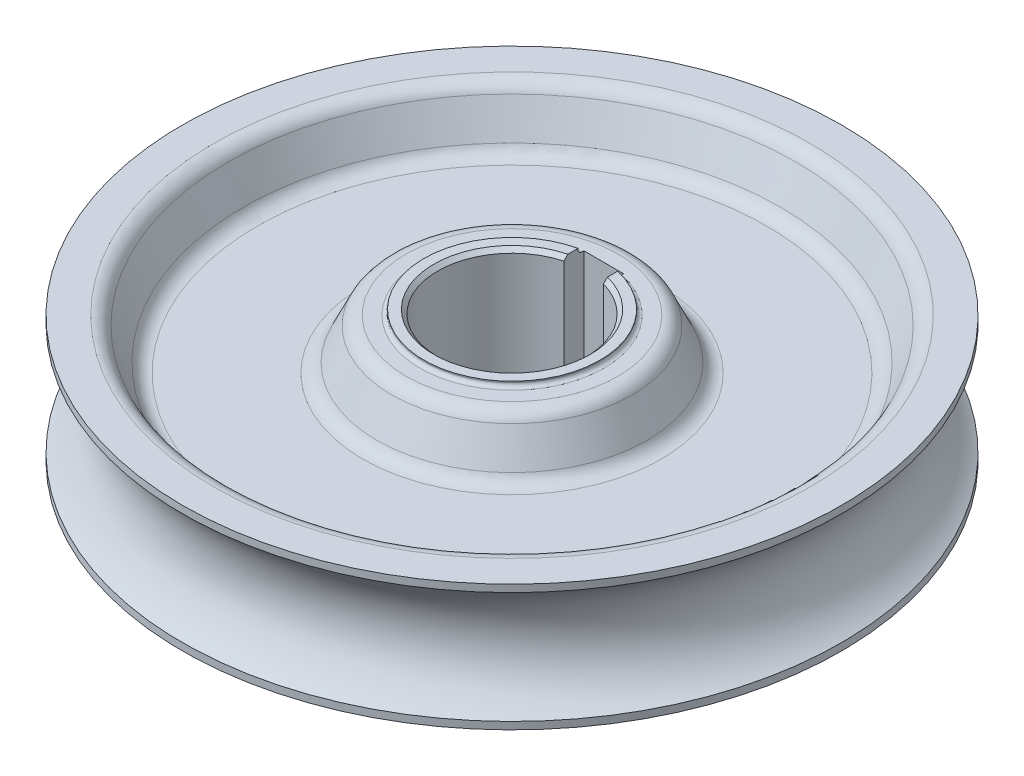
from build123d import *

# Parameters (mm, degrees)
CHAMFER1_SIZE      = 0.79375
SKETCH2_W          = 8
SKETCH2_H          = 18.5
CUT_EXTRUDE1_DEPTH = 99.00547448
SKETCH4_OUTSIDE_W  = 173.06
SKETCH4_OUTSIDE_H  = 173.06
SKETCH4_OUTSIDE_R  = 17.78
CUT_EXTRUDE2_DEPTH = 1.016
FILLET1_R          = 3.175
FILLET2_R          = 0.79375


with BuildPart() as part:
    # Sketch1 → Revolve1 (revolve)
    with BuildSketch(Plane(origin=(0, 0, 0), x_dir=(0, 0, -1), z_dir=(1, 0, 0))):
        with BuildLine():
            Line((66.51625, 11.260064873), (66.51625, 13.75))
            Line((66.51625, 13.75), (15, 13.75))
            Line((15, 13.75), (15, -13.75))
            Line((15, -13.75), (66.51625, -13.75))
            Line((66.51625, -13.75), (66.51625, -11.260064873))
            ThreePointArc((66.51625, -11.260064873), (60.325, 0), (66.51625, 11.260064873))
        make_face()
    revolve(axis=Axis((0, 0, 0), (0, 1, 0)))

    # Chamfer1
    chamfer1_edges = [part.edges().sort_by_distance(p)[0] for p in [
        (0, 13.75, 15),
        (0, -13.75, 15),
    ]]
    chamfer(chamfer1_edges, length=CHAMFER1_SIZE)

    # Sketch2 → Cut-Extrude1 (cut, through all)
    with BuildSketch(Plane(origin=(0, 13.75, 0), x_dir=(1, 0, 0), z_dir=(0, 1, 0))):
        with Locations((0, 9.25)):
            Rectangle(SKETCH2_W, SKETCH2_H)
    extrude(amount=-CUT_EXTRUDE1_DEPTH, mode=Mode.SUBTRACT)

    # Sketch3 → Cut-Revolve1 (revolve, cut)
    with BuildSketch(Plane(origin=(0, 0, 0), x_dir=(0, 0, -1), z_dir=(1, 0, 0)), mode=Mode.PRIVATE) as cut_revolve1_sk:
        Polygon((22.9375, -13.75), (28.119343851, -2.6375), (53.396906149, -2.6375), (58.57875, -13.75), align=None)
    cut_revolve1 = revolve(cut_revolve1_sk.sketch.rotate(Axis((0, 0, 0), (0, -1, 0)), 180), axis=Axis((0, 0, 0), (0, -1, 0)), mode=Mode.SUBTRACT)

    # Mirror1: Cut-Revolve1 across plane
    add(cut_revolve1.mirror(Plane.ZX), mode=Mode.SUBTRACT)

    # Sketch4 outside → Cut-Extrude2 (cut)
    with BuildSketch(Plane.XZ.offset(13.75)):
        Rectangle(SKETCH4_OUTSIDE_W, SKETCH4_OUTSIDE_H)
        Circle(SKETCH4_OUTSIDE_R, mode=Mode.SUBTRACT)
    cut_extrude2 = extrude(amount=-CUT_EXTRUDE2_DEPTH, mode=Mode.SUBTRACT)

    # Mirror2: Cut-Extrude2 across plane
    add(cut_extrude2.mirror(Plane.ZX), mode=Mode.SUBTRACT)

    # Fillet1
    fillet1_edges = [part.edges().sort_by_distance(p)[0] for p in [
        (0, -2.6375, -28.119343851),
        (0, -2.6375, -53.396906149),
        (0, 2.6375, -28.119343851),
        (0, 2.6375, -53.396906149),
        (0, -12.734, -23.411268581),
        (0, -12.734, -58.104981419),
        (0, 12.734, -23.411268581),
        (0, 12.734, -58.104981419),
    ]]
    fillet(fillet1_edges, radius=FILLET1_R)

    # Fillet2
    fillet2_edges = [part.edges().sort_by_distance(p)[0] for p in [
        (0, -12.734, 17.78),
        (0, 12.734, 17.78),
    ]]
    fillet(fillet2_edges, radius=FILLET2_R)


solid = part.part
